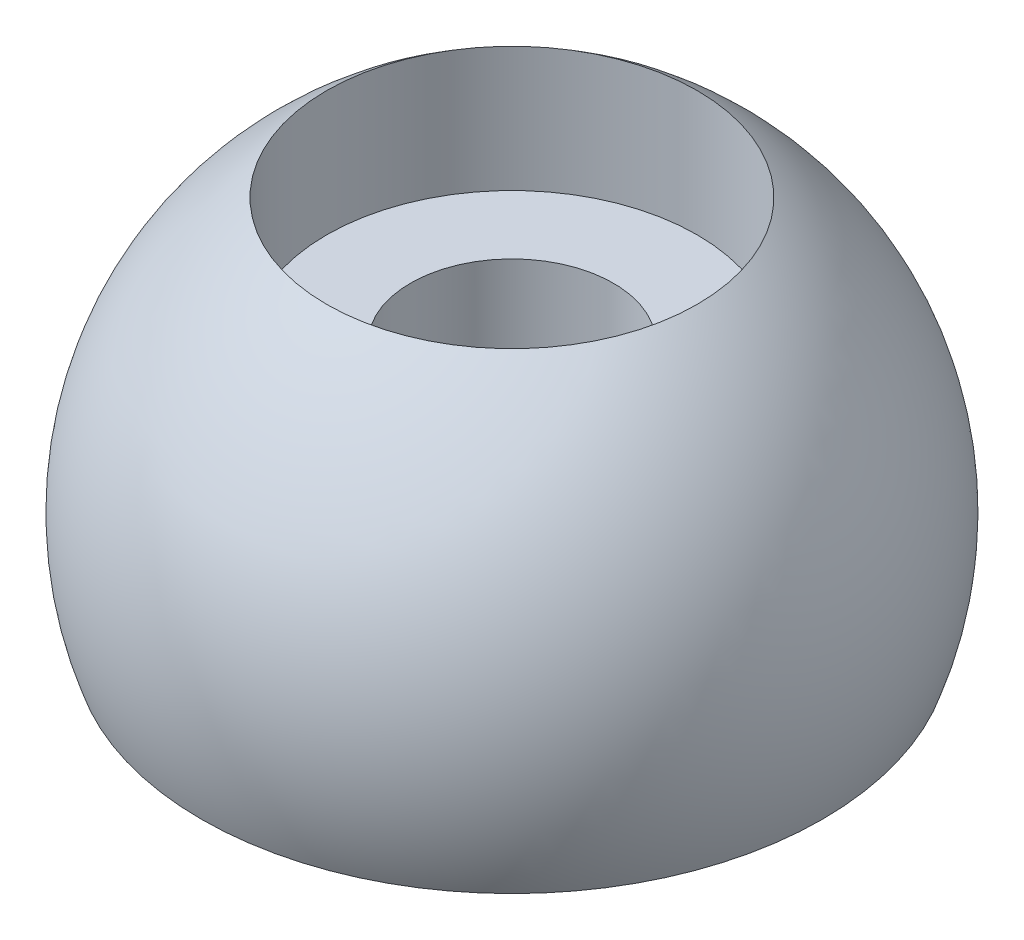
ISO-10303-21;
HEADER;
FILE_DESCRIPTION(('STEP AP214'),'2;1');
FILE_NAME('part.step','',(''),(''),'','','');
FILE_SCHEMA(('AUTOMOTIVE_DESIGN { 1 0 10303 214 1 1 1 1 }'));
ENDSEC;
DATA;
#1=APPLICATION_CONTEXT('core data for automotive mechanical design processes');
#2=APPLICATION_PROTOCOL_DEFINITION('international standard','automotive_design',2000,#1);
#3=PRODUCT_CONTEXT('',#1,'mechanical');
#4=PRODUCT('Part','Part','',(#3));
#5=PRODUCT_RELATED_PRODUCT_CATEGORY('part','',(#4));
#6=PRODUCT_DEFINITION_FORMATION('','',#4);
#7=PRODUCT_DEFINITION_CONTEXT('part definition',#1,'design');
#8=PRODUCT_DEFINITION('design','',#6,#7);
#9=PRODUCT_DEFINITION_SHAPE('','',#8);
#10=(LENGTH_UNIT() NAMED_UNIT(*) SI_UNIT(.MILLI.,.METRE.));
#11=(NAMED_UNIT(*) PLANE_ANGLE_UNIT() SI_UNIT($,.RADIAN.));
#12=(NAMED_UNIT(*) SI_UNIT($,.STERADIAN.) SOLID_ANGLE_UNIT());
#13=UNCERTAINTY_MEASURE_WITH_UNIT(LENGTH_MEASURE(1.E-05),#10,'distance_accuracy_value','');
#14=(GEOMETRIC_REPRESENTATION_CONTEXT(3) GLOBAL_UNCERTAINTY_ASSIGNED_CONTEXT((#13)) GLOBAL_UNIT_ASSIGNED_CONTEXT((#10,
#11,#12)) REPRESENTATION_CONTEXT('',''));
#15=CARTESIAN_POINT('',(0.,0.,0.));
#16=DIRECTION('',(0.,0.,1.));
#17=DIRECTION('',(1.,0.,0.));
#18=AXIS2_PLACEMENT_3D('',#15,#16,#17);
#19=CARTESIAN_POINT('',(0.,0.,0.));
#20=DIRECTION('',(0.,1.,0.));
#21=DIRECTION('',(1.,0.,0.));
#22=AXIS2_PLACEMENT_3D('',#19,#20,#21);
#23=SPHERICAL_SURFACE('',#22,6.35);
#24=CARTESIAN_POINT('',(0.,-2.1336,0.));
#25=DIRECTION('',(0.,1.,0.));
#26=DIRECTION('',(0.,0.,1.));
#27=AXIS2_PLACEMENT_3D('',#24,#25,#26);
#28=CIRCLE('',#27,5.98082360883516);
#29=CARTESIAN_POINT('',(5.98082360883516,-2.1336,0.));
#30=VERTEX_POINT('',#29);
#31=EDGE_CURVE('E10',#30,#30,#28,.T.);
#32=CARTESIAN_POINT('',(0.,5.25232142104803,0.));
#33=DIRECTION('',(0.,-1.,0.));
#34=DIRECTION('',(0.,0.,-1.));
#35=AXIS2_PLACEMENT_3D('',#32,#33,#34);
#36=CIRCLE('',#35,3.5687);
#37=CARTESIAN_POINT('',(3.5687,5.25232142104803,0.));
#38=VERTEX_POINT('',#37);
#39=EDGE_CURVE('E29',#38,#38,#36,.F.);
#40=CARTESIAN_POINT('',(5.98082360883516,-2.1336,0.));
#41=CARTESIAN_POINT('',(6.01008744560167,-2.05157200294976,0.));
#42=CARTESIAN_POINT('',(6.03766168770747,-1.96894134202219,0.));
#43=CARTESIAN_POINT('',(6.08938887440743,-1.80261598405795,0.));
#44=CARTESIAN_POINT('',(6.11354181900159,-1.7189212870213,0.));
#45=CARTESIAN_POINT('',(6.1583843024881,-1.55060914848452,0.));
#46=CARTESIAN_POINT('',(6.17907384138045,-1.46599170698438,0.));
#47=CARTESIAN_POINT('',(6.21695481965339,-1.29597741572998,0.));
#48=CARTESIAN_POINT('',(6.234146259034,-1.21058056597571,0.));
#49=CARTESIAN_POINT('',(6.26500185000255,-1.03915198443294,0.));
#50=CARTESIAN_POINT('',(6.27866600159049,-0.953120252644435,0.));
#51=CARTESIAN_POINT('',(6.30244391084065,-0.780567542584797,0.));
#52=CARTESIAN_POINT('',(6.31255766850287,-0.694046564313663,0.));
#53=CARTESIAN_POINT('',(6.32921766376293,-0.52066181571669,0.));
#54=CARTESIAN_POINT('',(6.33576390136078,-0.433798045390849,0.));
#55=CARTESIAN_POINT('',(6.34527777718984,-0.259874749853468,0.));
#56=CARTESIAN_POINT('',(6.34824541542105,-0.172815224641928,0.));
#57=CARTESIAN_POINT('',(6.35059706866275,0.00135221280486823,0.));
#58=CARTESIAN_POINT('',(6.34998108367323,0.0884601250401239,0.));
#59=CARTESIAN_POINT('',(6.34516653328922,0.262576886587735,0.));
#60=CARTESIAN_POINT('',(6.34096796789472,0.349585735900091,0.));
#61=CARTESIAN_POINT('',(6.32899536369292,0.523357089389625,0.));
#62=CARTESIAN_POINT('',(6.32122132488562,0.610119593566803,0.));
#63=CARTESIAN_POINT('',(6.3021109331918,0.783251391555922,0.));
#64=CARTESIAN_POINT('',(6.29077458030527,0.869620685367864,0.));
#65=CARTESIAN_POINT('',(6.26455874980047,1.04181986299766,0.));
#66=CARTESIAN_POINT('',(6.24967927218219,1.12764974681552,0.));
#67=CARTESIAN_POINT('',(6.21640237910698,1.29862481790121,0.));
#68=CARTESIAN_POINT('',(6.19800496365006,1.38377000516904,0.));
#69=CARTESIAN_POINT('',(6.15772333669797,1.55323155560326,0.));
#70=CARTESIAN_POINT('',(6.13583912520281,1.63754791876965,0.));
#71=CARTESIAN_POINT('',(6.08862095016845,1.8052090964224,0.));
#72=CARTESIAN_POINT('',(6.06328698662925,1.88855391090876,0.));
#73=CARTESIAN_POINT('',(6.00921219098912,2.05413091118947,0.));
#74=CARTESIAN_POINT('',(5.98047135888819,2.13636309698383,0.));
#75=CARTESIAN_POINT('',(5.91963147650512,2.29957564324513,0.));
#76=CARTESIAN_POINT('',(5.88753242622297,2.38055600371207,0.));
#77=CARTESIAN_POINT('',(5.82003044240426,2.54112782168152,0.));
#78=CARTESIAN_POINT('',(5.78462750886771,2.62071927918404,0.));
#79=CARTESIAN_POINT('',(5.7105776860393,2.77837856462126,0.));
#80=CARTESIAN_POINT('',(5.67193079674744,2.85644639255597,0.));
#81=CARTESIAN_POINT('',(5.59145848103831,3.01092627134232,0.));
#82=CARTESIAN_POINT('',(5.54963305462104,3.08733832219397,0.));
#83=CARTESIAN_POINT('',(5.46287446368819,3.2383773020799,0.));
#84=CARTESIAN_POINT('',(5.41794129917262,3.31300423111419,0.));
#85=CARTESIAN_POINT('',(5.32504329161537,3.46034664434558,0.));
#86=CARTESIAN_POINT('',(5.2770784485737,3.53306212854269,0.));
#87=CARTESIAN_POINT('',(5.17819827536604,3.67645856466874,0.));
#88=CARTESIAN_POINT('',(5.12728294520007,3.74713951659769,0.));
#89=CARTESIAN_POINT('',(5.02258798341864,3.88634724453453,0.));
#90=CARTESIAN_POINT('',(4.96880835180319,3.95487402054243,0.));
#91=CARTESIAN_POINT('',(4.85847582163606,4.08965739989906,0.));
#92=CARTESIAN_POINT('',(4.80192292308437,4.15591400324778,0.));
#93=CARTESIAN_POINT('',(4.68613958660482,4.28604488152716,0.));
#94=CARTESIAN_POINT('',(4.62690914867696,4.34991915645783,0.));
#95=CARTESIAN_POINT('',(4.50587099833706,4.47517726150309,0.));
#96=CARTESIAN_POINT('',(4.44406328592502,4.5365610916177,0.));
#97=CARTESIAN_POINT('',(4.31797519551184,4.65673438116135,0.));
#98=CARTESIAN_POINT('',(4.25369481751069,4.7155238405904,0.));
#99=CARTESIAN_POINT('',(4.12277025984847,4.83040894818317,0.));
#100=CARTESIAN_POINT('',(4.0561260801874,4.8865045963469,0.));
#101=CARTESIAN_POINT('',(3.92058652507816,4.99590685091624,0.));
#102=CARTESIAN_POINT('',(3.85169114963,5.04921345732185,0.));
#103=CARTESIAN_POINT('',(3.71176658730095,5.15294842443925,0.));
#104=CARTESIAN_POINT('',(3.64073740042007,5.20337678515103,0.));
#105=CARTESIAN_POINT('',(3.5687,5.25232142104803,0.));
#106=B_SPLINE_CURVE_WITH_KNOTS('',3,(#40,#41,#42,#43,#44,#45,#46,#47,#48,#49,#50,#51,#52,#53,
#54,#55,#56,#57,#58,#59,#60,#61,#62,#63,#64,#65,#66,#67,#68,#69,#70,#71,#72,#73,#74,#75,#76,#77,
#78,#79,#80,#81,#82,#83,#84,#85,#86,#87,#88,#89,#90,#91,#92,#93,#94,#95,#96,#97,#98,#99,#100,
#101,#102,#103,#104,#105),.UNSPECIFIED.,.F.,.F.,(4,2,2,2,2,2,2,2,2,2,2,2,2,2,2,2,2,2,2,2,2,2,2,
2,2,2,2,2,2,2,2,2,4),(0.,0.261256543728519,0.522513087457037,0.783769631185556,1.04502617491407,
1.30628271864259,1.56753926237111,1.82879580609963,2.09005234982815,2.35130889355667,
2.61256543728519,2.8738219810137,3.13507852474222,3.39633506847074,3.65759161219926,
3.91884815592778,4.1801046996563,4.44136124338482,4.70261778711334,4.96387433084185,
5.22513087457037,5.48638741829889,5.74764396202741,6.00890050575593,6.27015704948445,
6.53141359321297,6.79267013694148,7.05392668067,7.31518322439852,7.57643976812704,
7.83769631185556,8.09895285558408,8.36020939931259),.UNSPECIFIED.);
#107=EDGE_CURVE('BSEAM26',#30,#38,#106,.T.);
#108=ORIENTED_EDGE('',*,*,#31,.T.);
#109=ORIENTED_EDGE('',*,*,#39,.F.);
#110=ORIENTED_EDGE('',*,*,#107,.T.);
#111=ORIENTED_EDGE('',*,*,#107,.F.);
#112=EDGE_LOOP('',(#108,#110,#109,#111));
#113=FACE_BOUND('',#112,.T.);
#114=ADVANCED_FACE('F26',(#113),#23,.T.);
#115=CARTESIAN_POINT('',(0.,-2.0066,0.));
#116=DIRECTION('',(0.,-1.,0.));
#117=DIRECTION('',(0.,0.,-1.));
#118=AXIS2_PLACEMENT_3D('',#115,#116,#117);
#119=PLANE('',#118);
#120=CARTESIAN_POINT('',(0.,-2.0066,0.));
#121=DIRECTION('',(0.,-1.,0.));
#122=DIRECTION('',(0.,0.,-1.));
#123=AXIS2_PLACEMENT_3D('',#120,#121,#122);
#124=CIRCLE('',#123,4.1275);
#125=CARTESIAN_POINT('',(0.,-2.0066,-4.1275));
#126=VERTEX_POINT('',#125);
#127=EDGE_CURVE('E33',#126,#126,#124,.T.);
#128=ORIENTED_EDGE('',*,*,#127,.T.);
#129=EDGE_LOOP('',(#128));
#130=FACE_BOUND('',#129,.T.);
#131=CARTESIAN_POINT('',(0.,-2.0066,0.));
#132=DIRECTION('',(0.,-1.,0.));
#133=DIRECTION('',(0.,0.,-1.));
#134=AXIS2_PLACEMENT_3D('',#131,#132,#133);
#135=CIRCLE('',#134,1.9558);
#136=CARTESIAN_POINT('',(0.,-2.0066,-1.9558));
#137=VERTEX_POINT('',#136);
#138=EDGE_CURVE('E41',#137,#137,#135,.F.);
#139=ORIENTED_EDGE('',*,*,#138,.T.);
#140=EDGE_LOOP('',(#139));
#141=FACE_BOUND('',#140,.T.);
#142=ADVANCED_FACE('F62',(#130,#141),#119,.T.);
#143=CARTESIAN_POINT('',(-5.98082360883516,-2.1336,-6.35));
#144=DIRECTION('',(0.,1.,0.));
#145=DIRECTION('',(0.,0.,1.));
#146=AXIS2_PLACEMENT_3D('',#143,#144,#145);
#147=PLANE('',#146);
#148=CARTESIAN_POINT('',(0.,-2.1336,0.));
#149=DIRECTION('',(0.,-1.,0.));
#150=DIRECTION('',(0.,0.,-1.));
#151=AXIS2_PLACEMENT_3D('',#148,#149,#150);
#152=CIRCLE('',#151,4.1275);
#153=CARTESIAN_POINT('',(0.,-2.1336,-4.1275));
#154=VERTEX_POINT('',#153);
#155=EDGE_CURVE('E38',#154,#154,#152,.T.);
#156=ORIENTED_EDGE('',*,*,#155,.F.);
#157=EDGE_LOOP('',(#156));
#158=FACE_BOUND('',#157,.T.);
#159=ORIENTED_EDGE('',*,*,#31,.F.);
#160=EDGE_LOOP('',(#159));
#161=FACE_BOUND('',#160,.T.);
#162=ADVANCED_FACE('F59',(#158,#161),#147,.F.);
#163=CARTESIAN_POINT('',(0.,-2.0066,0.));
#164=DIRECTION('',(0.,-1.,0.));
#165=DIRECTION('',(0.,0.,-1.));
#166=AXIS2_PLACEMENT_3D('',#163,#164,#165);
#167=CYLINDRICAL_SURFACE('',#166,4.1275);
#168=ORIENTED_EDGE('',*,*,#127,.F.);
#169=EDGE_LOOP('',(#168));
#170=FACE_BOUND('',#169,.T.);
#171=ORIENTED_EDGE('',*,*,#155,.T.);
#172=EDGE_LOOP('',(#171));
#173=FACE_BOUND('',#172,.T.);
#174=ADVANCED_FACE('F57',(#170,#173),#167,.F.);
#175=CARTESIAN_POINT('',(0.,7.81837307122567,0.));
#176=DIRECTION('',(0.,1.,0.));
#177=DIRECTION('',(0.,0.,1.));
#178=AXIS2_PLACEMENT_3D('',#175,#176,#177);
#179=CYLINDRICAL_SURFACE('',#178,3.5687);
#180=CARTESIAN_POINT('',(0.,2.8448,0.));
#181=DIRECTION('',(0.,1.,0.));
#182=DIRECTION('',(0.,0.,1.));
#183=AXIS2_PLACEMENT_3D('',#180,#181,#182);
#184=CIRCLE('',#183,3.5687);
#185=CARTESIAN_POINT('',(0.,2.8448,3.5687));
#186=VERTEX_POINT('',#185);
#187=EDGE_CURVE('E48',#186,#186,#184,.T.);
#188=ORIENTED_EDGE('',*,*,#187,.F.);
#189=EDGE_LOOP('',(#188));
#190=FACE_BOUND('',#189,.T.);
#191=ORIENTED_EDGE('',*,*,#39,.T.);
#192=EDGE_LOOP('',(#191));
#193=FACE_BOUND('',#192,.T.);
#194=ADVANCED_FACE('F66',(#190,#193),#179,.F.);
#195=CARTESIAN_POINT('',(0.,7.81837307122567,0.));
#196=DIRECTION('',(0.,1.,0.));
#197=DIRECTION('',(0.,0.,1.));
#198=AXIS2_PLACEMENT_3D('',#195,#196,#197);
#199=CYLINDRICAL_SURFACE('',#198,1.9558);
#200=ORIENTED_EDGE('',*,*,#138,.F.);
#201=EDGE_LOOP('',(#200));
#202=FACE_BOUND('',#201,.T.);
#203=CARTESIAN_POINT('',(0.,2.8448,0.));
#204=DIRECTION('',(0.,1.,0.));
#205=DIRECTION('',(0.,0.,1.));
#206=AXIS2_PLACEMENT_3D('',#203,#204,#205);
#207=CIRCLE('',#206,1.9558);
#208=CARTESIAN_POINT('',(0.,2.8448,1.9558));
#209=VERTEX_POINT('',#208);
#210=EDGE_CURVE('E43',#209,#209,#207,.T.);
#211=ORIENTED_EDGE('',*,*,#210,.T.);
#212=EDGE_LOOP('',(#211));
#213=FACE_BOUND('',#212,.T.);
#214=ADVANCED_FACE('F79',(#202,#213),#199,.F.);
#215=CARTESIAN_POINT('',(3.5687,2.8448,0.));
#216=DIRECTION('',(0.,1.,0.));
#217=DIRECTION('',(0.,0.,1.));
#218=AXIS2_PLACEMENT_3D('',#215,#216,#217);
#219=PLANE('',#218);
#220=ORIENTED_EDGE('',*,*,#187,.T.);
#221=EDGE_LOOP('',(#220));
#222=FACE_BOUND('',#221,.T.);
#223=ORIENTED_EDGE('',*,*,#210,.F.);
#224=EDGE_LOOP('',(#223));
#225=FACE_BOUND('',#224,.T.);
#226=ADVANCED_FACE('F85',(#222,#225),#219,.T.);
#227=CLOSED_SHELL('',(#114,#142,#162,#174,#194,#214,#226));
#228=MANIFOLD_SOLID_BREP('B2',#227);
#229=ADVANCED_BREP_SHAPE_REPRESENTATION('',(#18,#228),#14);
#230=SHAPE_DEFINITION_REPRESENTATION(#9,#229);
ENDSEC;
END-ISO-10303-21;
